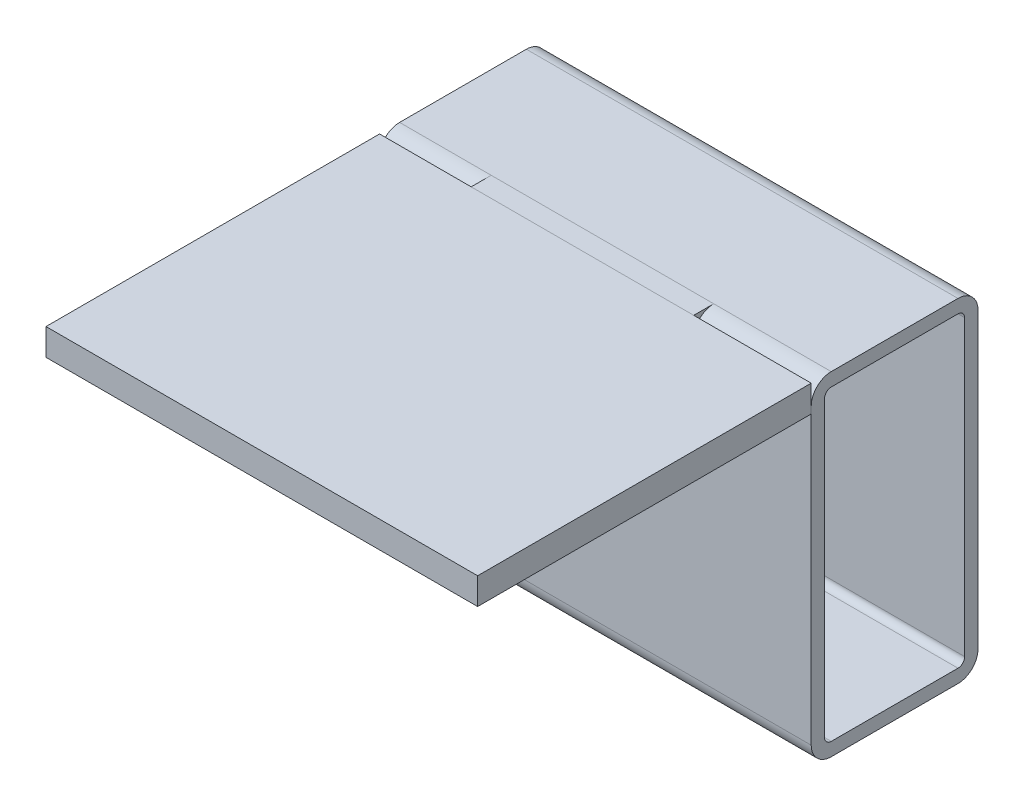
ISO-10303-21;
HEADER;
FILE_DESCRIPTION(('STEP AP214'),'2;1');
FILE_NAME('part.step','',(''),(''),'','','');
FILE_SCHEMA(('AUTOMOTIVE_DESIGN { 1 0 10303 214 1 1 1 1 }'));
ENDSEC;
DATA;
#1=APPLICATION_CONTEXT('core data for automotive mechanical design processes');
#2=APPLICATION_PROTOCOL_DEFINITION('international standard','automotive_design',2000,#1);
#3=PRODUCT_CONTEXT('',#1,'mechanical');
#4=PRODUCT('Part','Part','',(#3));
#5=PRODUCT_RELATED_PRODUCT_CATEGORY('part','',(#4));
#6=PRODUCT_DEFINITION_FORMATION('','',#4);
#7=PRODUCT_DEFINITION_CONTEXT('part definition',#1,'design');
#8=PRODUCT_DEFINITION('design','',#6,#7);
#9=PRODUCT_DEFINITION_SHAPE('','',#8);
#10=(LENGTH_UNIT() NAMED_UNIT(*) SI_UNIT(.MILLI.,.METRE.));
#11=(NAMED_UNIT(*) PLANE_ANGLE_UNIT() SI_UNIT($,.RADIAN.));
#12=(NAMED_UNIT(*) SI_UNIT($,.STERADIAN.) SOLID_ANGLE_UNIT());
#13=UNCERTAINTY_MEASURE_WITH_UNIT(LENGTH_MEASURE(1.E-05),#10,'distance_accuracy_value','');
#14=(GEOMETRIC_REPRESENTATION_CONTEXT(3) GLOBAL_UNCERTAINTY_ASSIGNED_CONTEXT((#13)) GLOBAL_UNIT_ASSIGNED_CONTEXT((#10,
#11,#12)) REPRESENTATION_CONTEXT('',''));
#15=CARTESIAN_POINT('',(0.,0.,0.));
#16=DIRECTION('',(0.,0.,1.));
#17=DIRECTION('',(1.,0.,0.));
#18=AXIS2_PLACEMENT_3D('',#15,#16,#17);
#19=CARTESIAN_POINT('',(-101.938843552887,0.,-5.99999999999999));
#20=DIRECTION('',(0.,-1.,0.));
#21=DIRECTION('',(0.,0.,-1.));
#22=AXIS2_PLACEMENT_3D('',#19,#20,#21);
#23=PLANE('',#22);
#24=DIRECTION('',(0.,0.,1.));
#25=VECTOR('',#24,1.);
#26=CARTESIAN_POINT('',(-101.938843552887,0.,0.));
#27=LINE('',#26,#25);
#28=CARTESIAN_POINT('',(-101.938843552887,0.,-5.99999999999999));
#29=VERTEX_POINT('',#28);
#30=CARTESIAN_POINT('',(-101.938843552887,0.,0.));
#31=VERTEX_POINT('',#30);
#32=EDGE_CURVE('E82',#29,#31,#27,.T.);
#33=ORIENTED_EDGE('',*,*,#32,.T.);
#34=DIRECTION('',(1.,0.,0.));
#35=VECTOR('',#34,1.);
#36=CARTESIAN_POINT('',(-101.938843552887,0.,0.));
#37=LINE('',#36,#35);
#38=CARTESIAN_POINT('',(-35.2215699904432,0.,0.));
#39=VERTEX_POINT('',#38);
#40=EDGE_CURVE('E87',#31,#39,#37,.T.);
#41=ORIENTED_EDGE('',*,*,#40,.T.);
#42=DIRECTION('',(0.,0.,-1.));
#43=VECTOR('',#42,1.);
#44=CARTESIAN_POINT('',(-35.2215699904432,0.,0.));
#45=LINE('',#44,#43);
#46=CARTESIAN_POINT('',(-35.2215699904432,0.,-6.));
#47=VERTEX_POINT('',#46);
#48=EDGE_CURVE('E93',#39,#47,#45,.T.);
#49=ORIENTED_EDGE('',*,*,#48,.T.);
#50=DIRECTION('',(-1.,0.,0.));
#51=VECTOR('',#50,1.);
#52=CARTESIAN_POINT('',(-101.938843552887,0.,-5.99999999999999));
#53=LINE('',#52,#51);
#54=EDGE_CURVE('E62',#47,#29,#53,.T.);
#55=ORIENTED_EDGE('',*,*,#54,.T.);
#56=EDGE_LOOP('',(#33,#41,#49,#55));
#57=FACE_BOUND('',#56,.T.);
#58=ADVANCED_FACE('F46',(#57),#23,.F.);
#59=CARTESIAN_POINT('',(-101.938843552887,-100.001,0.));
#60=DIRECTION('',(0.,0.,1.));
#61=DIRECTION('',(0.,-1.,0.));
#62=AXIS2_PLACEMENT_3D('',#59,#60,#61);
#63=PLANE('',#62);
#64=DIRECTION('',(1.,0.,0.));
#65=VECTOR('',#64,1.);
#66=CARTESIAN_POINT('',(-129.398954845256,-5.99999999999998,0.));
#67=LINE('',#66,#65);
#68=CARTESIAN_POINT('',(-35.2215699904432,-5.99999999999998,0.));
#69=VERTEX_POINT('',#68);
#70=CARTESIAN_POINT('',(-101.938843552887,-5.99999999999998,0.));
#71=VERTEX_POINT('',#70);
#72=EDGE_CURVE('E50',#69,#71,#67,.F.);
#73=ORIENTED_EDGE('',*,*,#72,.F.);
#74=DIRECTION('',(0.,1.,0.));
#75=VECTOR('',#74,1.);
#76=CARTESIAN_POINT('',(-35.2215699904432,-100.001,0.));
#77=LINE('',#76,#75);
#78=EDGE_CURVE('E85',#69,#39,#77,.T.);
#79=ORIENTED_EDGE('',*,*,#78,.T.);
#80=ORIENTED_EDGE('',*,*,#40,.F.);
#81=DIRECTION('',(0.,1.,0.));
#82=VECTOR('',#81,1.);
#83=CARTESIAN_POINT('',(-101.938843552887,-100.001,0.));
#84=LINE('',#83,#82);
#85=EDGE_CURVE('E79',#71,#31,#84,.T.);
#86=ORIENTED_EDGE('',*,*,#85,.F.);
#87=EDGE_LOOP('',(#73,#79,#80,#86));
#88=FACE_BOUND('',#87,.T.);
#89=ADVANCED_FACE('F88',(#88),#63,.T.);
#90=CARTESIAN_POINT('',(-35.2215699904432,-100.001,0.));
#91=DIRECTION('',(1.,0.,0.));
#92=DIRECTION('',(0.,0.,-1.));
#93=AXIS2_PLACEMENT_3D('',#90,#91,#92);
#94=PLANE('',#93);
#95=ORIENTED_EDGE('',*,*,#78,.F.);
#96=CARTESIAN_POINT('',(-35.2215699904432,-5.99999999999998,-6.));
#97=DIRECTION('',(1.,0.,0.));
#98=DIRECTION('',(0.,0.,-1.));
#99=AXIS2_PLACEMENT_3D('',#96,#97,#98);
#100=CIRCLE('',#99,6.00000000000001);
#101=EDGE_CURVE('E12',#69,#47,#100,.F.);
#102=ORIENTED_EDGE('',*,*,#101,.T.);
#103=ORIENTED_EDGE('',*,*,#48,.F.);
#104=EDGE_LOOP('',(#95,#102,#103));
#105=FACE_BOUND('',#104,.T.);
#106=ADVANCED_FACE('F101',(#105),#94,.T.);
#107=CARTESIAN_POINT('',(-101.938843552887,-100.001,0.));
#108=DIRECTION('',(-1.,0.,0.));
#109=DIRECTION('',(0.,0.,1.));
#110=AXIS2_PLACEMENT_3D('',#107,#108,#109);
#111=PLANE('',#110);
#112=ORIENTED_EDGE('',*,*,#32,.F.);
#113=CARTESIAN_POINT('',(-101.938843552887,-5.99999999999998,-6.));
#114=DIRECTION('',(-1.,0.,0.));
#115=DIRECTION('',(0.,0.,1.));
#116=AXIS2_PLACEMENT_3D('',#113,#114,#115);
#117=CIRCLE('',#116,6.00000000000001);
#118=EDGE_CURVE('E83',#29,#71,#117,.F.);
#119=ORIENTED_EDGE('',*,*,#118,.T.);
#120=ORIENTED_EDGE('',*,*,#85,.T.);
#121=EDGE_LOOP('',(#112,#119,#120));
#122=FACE_BOUND('',#121,.T.);
#123=ADVANCED_FACE('F48',(#122),#111,.T.);
#124=CARTESIAN_POINT('',(-129.398954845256,-5.99999999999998,-6.));
#125=DIRECTION('',(1.,0.,0.));
#126=DIRECTION('',(0.,0.,-1.));
#127=AXIS2_PLACEMENT_3D('',#124,#125,#126);
#128=CYLINDRICAL_SURFACE('',#127,6.00000000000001);
#129=ORIENTED_EDGE('',*,*,#54,.F.);
#130=ORIENTED_EDGE('',*,*,#101,.F.);
#131=ORIENTED_EDGE('',*,*,#72,.T.);
#132=ORIENTED_EDGE('',*,*,#118,.F.);
#133=EDGE_LOOP('',(#129,#130,#131,#132));
#134=FACE_BOUND('',#133,.T.);
#135=ADVANCED_FACE('F102',(#134),#128,.F.);
#136=CLOSED_SHELL('',(#58,#89,#106,#123,#135));
#137=MANIFOLD_SOLID_BREP('B2',#136);
#138=CARTESIAN_POINT('',(-129.398954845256,-5.99999999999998,-6.));
#139=DIRECTION('',(1.,0.,0.));
#140=DIRECTION('',(0.,0.,-1.));
#141=AXIS2_PLACEMENT_3D('',#138,#139,#140);
#142=CYLINDRICAL_SURFACE('',#141,2.00000000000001);
#143=CARTESIAN_POINT('',(0.,-5.99999999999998,-6.));
#144=DIRECTION('',(-1.,0.,0.));
#145=DIRECTION('',(0.,0.,-1.));
#146=AXIS2_PLACEMENT_3D('',#143,#144,#145);
#147=CIRCLE('',#146,2.00000000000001);
#148=CARTESIAN_POINT('',(0.,-5.99999999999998,-3.99999999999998));
#149=VERTEX_POINT('',#148);
#150=CARTESIAN_POINT('',(0.,-3.99999999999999,-6.));
#151=VERTEX_POINT('',#150);
#152=EDGE_CURVE('E322',#149,#151,#147,.T.);
#153=ORIENTED_EDGE('',*,*,#152,.F.);
#154=DIRECTION('',(1.,0.,0.));
#155=VECTOR('',#154,1.);
#156=CARTESIAN_POINT('',(-129.398954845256,-5.99999999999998,-3.99999999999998));
#157=LINE('',#156,#155);
#158=CARTESIAN_POINT('',(-129.398954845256,-5.99999999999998,-3.99999999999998));
#159=VERTEX_POINT('',#158);
#160=EDGE_CURVE('E44',#159,#149,#157,.T.);
#161=ORIENTED_EDGE('',*,*,#160,.F.);
#162=CARTESIAN_POINT('',(-129.398954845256,-5.99999999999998,-6.));
#163=DIRECTION('',(-1.,0.,0.));
#164=DIRECTION('',(0.,0.,-1.));
#165=AXIS2_PLACEMENT_3D('',#162,#163,#164);
#166=CIRCLE('',#165,2.00000000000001);
#167=CARTESIAN_POINT('',(-129.398954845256,-3.99999999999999,-6.));
#168=VERTEX_POINT('',#167);
#169=EDGE_CURVE('E407',#159,#168,#166,.T.);
#170=ORIENTED_EDGE('',*,*,#169,.T.);
#171=DIRECTION('',(1.,0.,0.));
#172=VECTOR('',#171,1.);
#173=CARTESIAN_POINT('',(-129.398954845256,-3.99999999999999,-6.));
#174=LINE('',#173,#172);
#175=EDGE_CURVE('E174',#168,#151,#174,.T.);
#176=ORIENTED_EDGE('',*,*,#175,.T.);
#177=EDGE_LOOP('',(#153,#161,#170,#176));
#178=FACE_BOUND('',#177,.T.);
#179=ADVANCED_FACE('F155',(#178),#142,.F.);
#180=CARTESIAN_POINT('',(-129.398954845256,-5.99999999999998,-3.99999999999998));
#181=DIRECTION('',(0.,0.,-1.));
#182=DIRECTION('',(-1.,0.,0.));
#183=AXIS2_PLACEMENT_3D('',#180,#181,#182);
#184=PLANE('',#183);
#185=DIRECTION('',(0.,1.,0.));
#186=VECTOR('',#185,1.);
#187=CARTESIAN_POINT('',(0.,-5.99999999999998,-3.99999999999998));
#188=LINE('',#187,#186);
#189=CARTESIAN_POINT('',(0.,-94.,-3.99999999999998));
#190=VERTEX_POINT('',#189);
#191=EDGE_CURVE('E324',#190,#149,#188,.T.);
#192=ORIENTED_EDGE('',*,*,#191,.F.);
#193=DIRECTION('',(1.,0.,0.));
#194=VECTOR('',#193,1.);
#195=CARTESIAN_POINT('',(-129.398954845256,-94.,-3.99999999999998));
#196=LINE('',#195,#194);
#197=CARTESIAN_POINT('',(-129.398954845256,-94.,-3.99999999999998));
#198=VERTEX_POINT('',#197);
#199=EDGE_CURVE('E165',#198,#190,#196,.T.);
#200=ORIENTED_EDGE('',*,*,#199,.F.);
#201=DIRECTION('',(0.,1.,0.));
#202=VECTOR('',#201,1.);
#203=CARTESIAN_POINT('',(-129.398954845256,-5.99999999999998,-3.99999999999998));
#204=LINE('',#203,#202);
#205=EDGE_CURVE('E409',#198,#159,#204,.T.);
#206=ORIENTED_EDGE('',*,*,#205,.T.);
#207=ORIENTED_EDGE('',*,*,#160,.T.);
#208=EDGE_LOOP('',(#192,#200,#206,#207));
#209=FACE_BOUND('',#208,.T.);
#210=ADVANCED_FACE('F436',(#209),#184,.T.);
#211=CARTESIAN_POINT('',(-129.398954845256,-94.,-5.99999999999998));
#212=DIRECTION('',(1.,0.,0.));
#213=DIRECTION('',(0.,0.,-1.));
#214=AXIS2_PLACEMENT_3D('',#211,#212,#213);
#215=CYLINDRICAL_SURFACE('',#214,2.);
#216=CARTESIAN_POINT('',(0.,-94.,-5.99999999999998));
#217=DIRECTION('',(-1.,0.,0.));
#218=DIRECTION('',(0.,0.,-1.));
#219=AXIS2_PLACEMENT_3D('',#216,#217,#218);
#220=CIRCLE('',#219,2.);
#221=CARTESIAN_POINT('',(0.,-96.,-5.99999999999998));
#222=VERTEX_POINT('',#221);
#223=EDGE_CURVE('E327',#222,#190,#220,.T.);
#224=ORIENTED_EDGE('',*,*,#223,.F.);
#225=DIRECTION('',(1.,0.,0.));
#226=VECTOR('',#225,1.);
#227=CARTESIAN_POINT('',(-129.398954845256,-96.,-5.99999999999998));
#228=LINE('',#227,#226);
#229=CARTESIAN_POINT('',(-129.398954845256,-96.,-5.99999999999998));
#230=VERTEX_POINT('',#229);
#231=EDGE_CURVE('E348',#230,#222,#228,.T.);
#232=ORIENTED_EDGE('',*,*,#231,.F.);
#233=CARTESIAN_POINT('',(-129.398954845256,-94.,-5.99999999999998));
#234=DIRECTION('',(-1.,0.,0.));
#235=DIRECTION('',(0.,0.,-1.));
#236=AXIS2_PLACEMENT_3D('',#233,#234,#235);
#237=CIRCLE('',#236,2.);
#238=EDGE_CURVE('E412',#230,#198,#237,.T.);
#239=ORIENTED_EDGE('',*,*,#238,.T.);
#240=ORIENTED_EDGE('',*,*,#199,.T.);
#241=EDGE_LOOP('',(#224,#232,#239,#240));
#242=FACE_BOUND('',#241,.T.);
#243=ADVANCED_FACE('F441',(#242),#215,.F.);
#244=CARTESIAN_POINT('',(-129.398954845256,-96.,-5.99999999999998));
#245=DIRECTION('',(0.,1.,0.));
#246=DIRECTION('',(0.,0.,1.));
#247=AXIS2_PLACEMENT_3D('',#244,#245,#246);
#248=PLANE('',#247);
#249=DIRECTION('',(0.,0.,1.));
#250=VECTOR('',#249,1.);
#251=CARTESIAN_POINT('',(0.,-96.,-5.99999999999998));
#252=LINE('',#251,#250);
#253=CARTESIAN_POINT('',(0.,-96.,-44.));
#254=VERTEX_POINT('',#253);
#255=EDGE_CURVE('E330',#254,#222,#252,.T.);
#256=ORIENTED_EDGE('',*,*,#255,.F.);
#257=DIRECTION('',(1.,0.,0.));
#258=VECTOR('',#257,1.);
#259=CARTESIAN_POINT('',(-129.398954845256,-96.,-44.));
#260=LINE('',#259,#258);
#261=CARTESIAN_POINT('',(-129.398954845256,-96.,-44.));
#262=VERTEX_POINT('',#261);
#263=EDGE_CURVE('E346',#262,#254,#260,.T.);
#264=ORIENTED_EDGE('',*,*,#263,.F.);
#265=DIRECTION('',(0.,0.,1.));
#266=VECTOR('',#265,1.);
#267=CARTESIAN_POINT('',(-129.398954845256,-96.,-5.99999999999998));
#268=LINE('',#267,#266);
#269=EDGE_CURVE('E415',#262,#230,#268,.T.);
#270=ORIENTED_EDGE('',*,*,#269,.T.);
#271=ORIENTED_EDGE('',*,*,#231,.T.);
#272=EDGE_LOOP('',(#256,#264,#270,#271));
#273=FACE_BOUND('',#272,.T.);
#274=ADVANCED_FACE('F474',(#273),#248,.T.);
#275=CARTESIAN_POINT('',(-129.398954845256,-94.,-44.));
#276=DIRECTION('',(1.,0.,0.));
#277=DIRECTION('',(0.,0.,-1.));
#278=AXIS2_PLACEMENT_3D('',#275,#276,#277);
#279=CYLINDRICAL_SURFACE('',#278,2.00000000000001);
#280=CARTESIAN_POINT('',(0.,-94.,-44.));
#281=DIRECTION('',(-1.,0.,0.));
#282=DIRECTION('',(0.,0.,-1.));
#283=AXIS2_PLACEMENT_3D('',#280,#281,#282);
#284=CIRCLE('',#283,2.00000000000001);
#285=CARTESIAN_POINT('',(0.,-94.,-46.));
#286=VERTEX_POINT('',#285);
#287=EDGE_CURVE('E333',#286,#254,#284,.T.);
#288=ORIENTED_EDGE('',*,*,#287,.F.);
#289=DIRECTION('',(1.,0.,0.));
#290=VECTOR('',#289,1.);
#291=CARTESIAN_POINT('',(-129.398954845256,-94.,-46.));
#292=LINE('',#291,#290);
#293=CARTESIAN_POINT('',(-129.398954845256,-94.,-46.));
#294=VERTEX_POINT('',#293);
#295=EDGE_CURVE('E285',#294,#286,#292,.T.);
#296=ORIENTED_EDGE('',*,*,#295,.F.);
#297=CARTESIAN_POINT('',(-129.398954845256,-94.,-44.));
#298=DIRECTION('',(-1.,0.,0.));
#299=DIRECTION('',(0.,0.,-1.));
#300=AXIS2_PLACEMENT_3D('',#297,#298,#299);
#301=CIRCLE('',#300,2.00000000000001);
#302=EDGE_CURVE('E296',#294,#262,#301,.T.);
#303=ORIENTED_EDGE('',*,*,#302,.T.);
#304=ORIENTED_EDGE('',*,*,#263,.T.);
#305=EDGE_LOOP('',(#288,#296,#303,#304));
#306=FACE_BOUND('',#305,.T.);
#307=ADVANCED_FACE('F419',(#306),#279,.F.);
#308=CARTESIAN_POINT('',(-129.398954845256,-5.99999999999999,-46.));
#309=DIRECTION('',(0.,0.,1.));
#310=DIRECTION('',(1.,0.,0.));
#311=AXIS2_PLACEMENT_3D('',#308,#309,#310);
#312=PLANE('',#311);
#313=DIRECTION('',(0.,-1.,0.));
#314=VECTOR('',#313,1.);
#315=CARTESIAN_POINT('',(0.,-5.99999999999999,-46.));
#316=LINE('',#315,#314);
#317=CARTESIAN_POINT('',(0.,-5.99999999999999,-46.));
#318=VERTEX_POINT('',#317);
#319=EDGE_CURVE('E281',#318,#286,#316,.T.);
#320=ORIENTED_EDGE('',*,*,#319,.F.);
#321=DIRECTION('',(1.,0.,0.));
#322=VECTOR('',#321,1.);
#323=CARTESIAN_POINT('',(-129.398954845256,-5.99999999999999,-46.));
#324=LINE('',#323,#322);
#325=CARTESIAN_POINT('',(-129.398954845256,-5.99999999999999,-46.));
#326=VERTEX_POINT('',#325);
#327=EDGE_CURVE('E276',#326,#318,#324,.T.);
#328=ORIENTED_EDGE('',*,*,#327,.F.);
#329=DIRECTION('',(0.,-1.,0.));
#330=VECTOR('',#329,1.);
#331=CARTESIAN_POINT('',(-129.398954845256,-5.99999999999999,-46.));
#332=LINE('',#331,#330);
#333=EDGE_CURVE('E279',#326,#294,#332,.T.);
#334=ORIENTED_EDGE('',*,*,#333,.T.);
#335=ORIENTED_EDGE('',*,*,#295,.T.);
#336=EDGE_LOOP('',(#320,#328,#334,#335));
#337=FACE_BOUND('',#336,.T.);
#338=ADVANCED_FACE('F278',(#337),#312,.T.);
#339=CARTESIAN_POINT('',(-129.398954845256,-5.99999999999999,-44.));
#340=DIRECTION('',(1.,0.,0.));
#341=DIRECTION('',(0.,0.,-1.));
#342=AXIS2_PLACEMENT_3D('',#339,#340,#341);
#343=CYLINDRICAL_SURFACE('',#342,2.00000000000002);
#344=CARTESIAN_POINT('',(0.,-5.99999999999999,-44.));
#345=DIRECTION('',(-1.,0.,0.));
#346=DIRECTION('',(0.,0.,-1.));
#347=AXIS2_PLACEMENT_3D('',#344,#345,#346);
#348=CIRCLE('',#347,2.00000000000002);
#349=CARTESIAN_POINT('',(0.,-3.99999999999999,-44.));
#350=VERTEX_POINT('',#349);
#351=EDGE_CURVE('E337',#350,#318,#348,.T.);
#352=ORIENTED_EDGE('',*,*,#351,.F.);
#353=DIRECTION('',(1.,0.,0.));
#354=VECTOR('',#353,1.);
#355=CARTESIAN_POINT('',(-129.398954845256,-3.99999999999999,-44.));
#356=LINE('',#355,#354);
#357=CARTESIAN_POINT('',(-129.398954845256,-3.99999999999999,-44.));
#358=VERTEX_POINT('',#357);
#359=EDGE_CURVE('E223',#358,#350,#356,.T.);
#360=ORIENTED_EDGE('',*,*,#359,.F.);
#361=CARTESIAN_POINT('',(-129.398954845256,-5.99999999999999,-44.));
#362=DIRECTION('',(-1.,0.,0.));
#363=DIRECTION('',(0.,0.,-1.));
#364=AXIS2_PLACEMENT_3D('',#361,#362,#363);
#365=CIRCLE('',#364,2.00000000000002);
#366=EDGE_CURVE('E293',#358,#326,#365,.T.);
#367=ORIENTED_EDGE('',*,*,#366,.T.);
#368=ORIENTED_EDGE('',*,*,#327,.T.);
#369=EDGE_LOOP('',(#352,#360,#367,#368));
#370=FACE_BOUND('',#369,.T.);
#371=ADVANCED_FACE('F298',(#370),#343,.F.);
#372=CARTESIAN_POINT('',(-129.398954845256,-94.,-44.));
#373=DIRECTION('',(1.,0.,0.));
#374=DIRECTION('',(0.,0.,-1.));
#375=AXIS2_PLACEMENT_3D('',#372,#373,#374);
#376=CYLINDRICAL_SURFACE('',#375,6.00000000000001);
#377=CARTESIAN_POINT('',(0.,-94.,-44.));
#378=DIRECTION('',(-1.,0.,0.));
#379=DIRECTION('',(0.,0.,-1.));
#380=AXIS2_PLACEMENT_3D('',#377,#378,#379);
#381=CIRCLE('',#380,6.00000000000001);
#382=CARTESIAN_POINT('',(0.,-94.,-50.));
#383=VERTEX_POINT('',#382);
#384=CARTESIAN_POINT('',(0.,-100.,-44.));
#385=VERTEX_POINT('',#384);
#386=EDGE_CURVE('E305',#383,#385,#381,.T.);
#387=ORIENTED_EDGE('',*,*,#386,.T.);
#388=DIRECTION('',(1.,0.,0.));
#389=VECTOR('',#388,1.);
#390=CARTESIAN_POINT('',(-129.398954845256,-100.,-44.));
#391=LINE('',#390,#389);
#392=CARTESIAN_POINT('',(-129.398954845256,-100.,-44.));
#393=VERTEX_POINT('',#392);
#394=EDGE_CURVE('E159',#393,#385,#391,.T.);
#395=ORIENTED_EDGE('',*,*,#394,.F.);
#396=CARTESIAN_POINT('',(-129.398954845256,-94.,-44.));
#397=DIRECTION('',(-1.,0.,0.));
#398=DIRECTION('',(0.,0.,-1.));
#399=AXIS2_PLACEMENT_3D('',#396,#397,#398);
#400=CIRCLE('',#399,6.00000000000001);
#401=CARTESIAN_POINT('',(-129.398954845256,-94.,-50.));
#402=VERTEX_POINT('',#401);
#403=EDGE_CURVE('E342',#402,#393,#400,.T.);
#404=ORIENTED_EDGE('',*,*,#403,.F.);
#405=DIRECTION('',(1.,0.,0.));
#406=VECTOR('',#405,1.);
#407=CARTESIAN_POINT('',(-129.398954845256,-94.,-50.));
#408=LINE('',#407,#406);
#409=EDGE_CURVE('E301',#402,#383,#408,.T.);
#410=ORIENTED_EDGE('',*,*,#409,.T.);
#411=EDGE_LOOP('',(#387,#395,#404,#410));
#412=FACE_BOUND('',#411,.T.);
#413=ADVANCED_FACE('F157',(#412),#376,.T.);
#414=CARTESIAN_POINT('',(-129.398954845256,-100.,-5.99999999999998));
#415=DIRECTION('',(0.,1.,0.));
#416=DIRECTION('',(0.,0.,1.));
#417=AXIS2_PLACEMENT_3D('',#414,#415,#416);
#418=PLANE('',#417);
#419=DIRECTION('',(0.,0.,1.));
#420=VECTOR('',#419,1.);
#421=CARTESIAN_POINT('',(0.,-100.,-5.99999999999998));
#422=LINE('',#421,#420);
#423=CARTESIAN_POINT('',(0.,-100.,-5.99999999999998));
#424=VERTEX_POINT('',#423);
#425=EDGE_CURVE('E308',#385,#424,#422,.T.);
#426=ORIENTED_EDGE('',*,*,#425,.T.);
#427=DIRECTION('',(1.,0.,0.));
#428=VECTOR('',#427,1.);
#429=CARTESIAN_POINT('',(-129.398954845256,-100.,-5.99999999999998));
#430=LINE('',#429,#428);
#431=CARTESIAN_POINT('',(-129.398954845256,-100.,-5.99999999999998));
#432=VERTEX_POINT('',#431);
#433=EDGE_CURVE('E367',#432,#424,#430,.T.);
#434=ORIENTED_EDGE('',*,*,#433,.F.);
#435=DIRECTION('',(0.,0.,1.));
#436=VECTOR('',#435,1.);
#437=CARTESIAN_POINT('',(-129.398954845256,-100.,-5.99999999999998));
#438=LINE('',#437,#436);
#439=EDGE_CURVE('E236',#393,#432,#438,.T.);
#440=ORIENTED_EDGE('',*,*,#439,.F.);
#441=ORIENTED_EDGE('',*,*,#394,.T.);
#442=EDGE_LOOP('',(#426,#434,#440,#441));
#443=FACE_BOUND('',#442,.T.);
#444=ADVANCED_FACE('F373',(#443),#418,.F.);
#445=CARTESIAN_POINT('',(-129.398954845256,-94.,-5.99999999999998));
#446=DIRECTION('',(1.,0.,0.));
#447=DIRECTION('',(0.,0.,-1.));
#448=AXIS2_PLACEMENT_3D('',#445,#446,#447);
#449=CYLINDRICAL_SURFACE('',#448,6.00000000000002);
#450=CARTESIAN_POINT('',(0.,-94.,-5.99999999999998));
#451=DIRECTION('',(-1.,0.,0.));
#452=DIRECTION('',(0.,0.,-1.));
#453=AXIS2_PLACEMENT_3D('',#450,#451,#452);
#454=CIRCLE('',#453,6.00000000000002);
#455=CARTESIAN_POINT('',(0.,-94.,0.));
#456=VERTEX_POINT('',#455);
#457=EDGE_CURVE('E310',#424,#456,#454,.T.);
#458=ORIENTED_EDGE('',*,*,#457,.T.);
#459=DIRECTION('',(1.,0.,0.));
#460=VECTOR('',#459,1.);
#461=CARTESIAN_POINT('',(-129.398954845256,-94.,0.));
#462=LINE('',#461,#460);
#463=CARTESIAN_POINT('',(-129.398954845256,-94.,0.));
#464=VERTEX_POINT('',#463);
#465=EDGE_CURVE('E365',#464,#456,#462,.T.);
#466=ORIENTED_EDGE('',*,*,#465,.F.);
#467=CARTESIAN_POINT('',(-129.398954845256,-94.,-5.99999999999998));
#468=DIRECTION('',(-1.,0.,0.));
#469=DIRECTION('',(0.,0.,-1.));
#470=AXIS2_PLACEMENT_3D('',#467,#468,#469);
#471=CIRCLE('',#470,6.00000000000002);
#472=EDGE_CURVE('E395',#432,#464,#471,.T.);
#473=ORIENTED_EDGE('',*,*,#472,.F.);
#474=ORIENTED_EDGE('',*,*,#433,.T.);
#475=EDGE_LOOP('',(#458,#466,#473,#474));
#476=FACE_BOUND('',#475,.T.);
#477=ADVANCED_FACE('F386',(#476),#449,.T.);
#478=CARTESIAN_POINT('',(-129.398954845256,-5.99999999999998,0.));
#479=DIRECTION('',(0.,0.,-1.));
#480=DIRECTION('',(0.,1.,0.));
#481=AXIS2_PLACEMENT_3D('',#478,#479,#480);
#482=PLANE('',#481);
#483=DIRECTION('',(0.,1.,0.));
#484=VECTOR('',#483,1.);
#485=CARTESIAN_POINT('',(0.,-5.99999999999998,0.));
#486=LINE('',#485,#484);
#487=CARTESIAN_POINT('',(0.,-5.99999999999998,0.));
#488=VERTEX_POINT('',#487);
#489=EDGE_CURVE('E312',#456,#488,#486,.T.);
#490=ORIENTED_EDGE('',*,*,#489,.T.);
#491=DIRECTION('',(1.,0.,0.));
#492=VECTOR('',#491,1.);
#493=CARTESIAN_POINT('',(-129.398954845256,-5.99999999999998,0.));
#494=LINE('',#493,#492);
#495=CARTESIAN_POINT('',(-129.398954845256,-5.99999999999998,0.));
#496=VERTEX_POINT('',#495);
#497=EDGE_CURVE('E362',#496,#488,#494,.T.);
#498=ORIENTED_EDGE('',*,*,#497,.F.);
#499=DIRECTION('',(0.,1.,0.));
#500=VECTOR('',#499,1.);
#501=CARTESIAN_POINT('',(-129.398954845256,-5.99999999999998,0.));
#502=LINE('',#501,#500);
#503=EDGE_CURVE('E391',#464,#496,#502,.T.);
#504=ORIENTED_EDGE('',*,*,#503,.F.);
#505=ORIENTED_EDGE('',*,*,#465,.T.);
#506=EDGE_LOOP('',(#490,#498,#504,#505));
#507=FACE_BOUND('',#506,.T.);
#508=ADVANCED_FACE('F389',(#507),#482,.F.);
#509=CARTESIAN_POINT('',(-129.398954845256,-5.99999999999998,-6.));
#510=DIRECTION('',(1.,0.,0.));
#511=DIRECTION('',(0.,0.,-1.));
#512=AXIS2_PLACEMENT_3D('',#509,#510,#511);
#513=CYLINDRICAL_SURFACE('',#512,6.00000000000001);
#514=CARTESIAN_POINT('',(0.,-5.99999999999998,-6.));
#515=DIRECTION('',(-1.,0.,0.));
#516=DIRECTION('',(0.,0.,-1.));
#517=AXIS2_PLACEMENT_3D('',#514,#515,#516);
#518=CIRCLE('',#517,6.00000000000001);
#519=CARTESIAN_POINT('',(0.,0.,-6.));
#520=VERTEX_POINT('',#519);
#521=EDGE_CURVE('E314',#488,#520,#518,.T.);
#522=ORIENTED_EDGE('',*,*,#521,.T.);
#523=DIRECTION('',(1.,0.,0.));
#524=VECTOR('',#523,1.);
#525=CARTESIAN_POINT('',(-129.398954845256,0.,-6.));
#526=LINE('',#525,#524);
#527=CARTESIAN_POINT('',(-129.398954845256,0.,-6.));
#528=VERTEX_POINT('',#527);
#529=EDGE_CURVE('E359',#528,#520,#526,.T.);
#530=ORIENTED_EDGE('',*,*,#529,.F.);
#531=CARTESIAN_POINT('',(-129.398954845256,-5.99999999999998,-6.));
#532=DIRECTION('',(-1.,0.,0.));
#533=DIRECTION('',(0.,0.,-1.));
#534=AXIS2_PLACEMENT_3D('',#531,#532,#533);
#535=CIRCLE('',#534,6.00000000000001);
#536=EDGE_CURVE('E394',#496,#528,#535,.T.);
#537=ORIENTED_EDGE('',*,*,#536,.F.);
#538=ORIENTED_EDGE('',*,*,#497,.T.);
#539=EDGE_LOOP('',(#522,#530,#537,#538));
#540=FACE_BOUND('',#539,.T.);
#541=ADVANCED_FACE('F452',(#540),#513,.T.);
#542=CARTESIAN_POINT('',(-129.398954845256,0.,-5.99999999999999));
#543=DIRECTION('',(0.,-1.,0.));
#544=DIRECTION('',(0.,0.,-1.));
#545=AXIS2_PLACEMENT_3D('',#542,#543,#544);
#546=PLANE('',#545);
#547=DIRECTION('',(0.,0.,-1.));
#548=VECTOR('',#547,1.);
#549=CARTESIAN_POINT('',(0.,0.,-5.99999999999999));
#550=LINE('',#549,#548);
#551=CARTESIAN_POINT('',(0.,0.,-44.));
#552=VERTEX_POINT('',#551);
#553=EDGE_CURVE('E316',#520,#552,#550,.T.);
#554=ORIENTED_EDGE('',*,*,#553,.T.);
#555=DIRECTION('',(1.,0.,0.));
#556=VECTOR('',#555,1.);
#557=CARTESIAN_POINT('',(-129.398954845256,0.,-44.));
#558=LINE('',#557,#556);
#559=CARTESIAN_POINT('',(-129.398954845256,0.,-44.));
#560=VERTEX_POINT('',#559);
#561=EDGE_CURVE('E356',#560,#552,#558,.T.);
#562=ORIENTED_EDGE('',*,*,#561,.F.);
#563=DIRECTION('',(0.,0.,-1.));
#564=VECTOR('',#563,1.);
#565=CARTESIAN_POINT('',(-129.398954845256,0.,-5.99999999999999));
#566=LINE('',#565,#564);
#567=EDGE_CURVE('E397',#528,#560,#566,.T.);
#568=ORIENTED_EDGE('',*,*,#567,.F.);
#569=ORIENTED_EDGE('',*,*,#529,.T.);
#570=EDGE_LOOP('',(#554,#562,#568,#569));
#571=FACE_BOUND('',#570,.T.);
#572=ADVANCED_FACE('F448',(#571),#546,.F.);
#573=CARTESIAN_POINT('',(-129.398954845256,-5.99999999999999,-44.));
#574=DIRECTION('',(1.,0.,0.));
#575=DIRECTION('',(0.,0.,-1.));
#576=AXIS2_PLACEMENT_3D('',#573,#574,#575);
#577=CYLINDRICAL_SURFACE('',#576,6.00000000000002);
#578=CARTESIAN_POINT('',(0.,-5.99999999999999,-44.));
#579=DIRECTION('',(-1.,0.,0.));
#580=DIRECTION('',(0.,0.,-1.));
#581=AXIS2_PLACEMENT_3D('',#578,#579,#580);
#582=CIRCLE('',#581,6.00000000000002);
#583=CARTESIAN_POINT('',(0.,-5.99999999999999,-50.));
#584=VERTEX_POINT('',#583);
#585=EDGE_CURVE('E318',#552,#584,#582,.T.);
#586=ORIENTED_EDGE('',*,*,#585,.T.);
#587=DIRECTION('',(1.,0.,0.));
#588=VECTOR('',#587,1.);
#589=CARTESIAN_POINT('',(-129.398954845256,-5.99999999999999,-50.));
#590=LINE('',#589,#588);
#591=CARTESIAN_POINT('',(-129.398954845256,-5.99999999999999,-50.));
#592=VERTEX_POINT('',#591);
#593=EDGE_CURVE('E353',#592,#584,#590,.T.);
#594=ORIENTED_EDGE('',*,*,#593,.F.);
#595=CARTESIAN_POINT('',(-129.398954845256,-5.99999999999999,-44.));
#596=DIRECTION('',(-1.,0.,0.));
#597=DIRECTION('',(0.,0.,-1.));
#598=AXIS2_PLACEMENT_3D('',#595,#596,#597);
#599=CIRCLE('',#598,6.00000000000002);
#600=EDGE_CURVE('E403',#560,#592,#599,.T.);
#601=ORIENTED_EDGE('',*,*,#600,.F.);
#602=ORIENTED_EDGE('',*,*,#561,.T.);
#603=EDGE_LOOP('',(#586,#594,#601,#602));
#604=FACE_BOUND('',#603,.T.);
#605=ADVANCED_FACE('F430',(#604),#577,.T.);
#606=CARTESIAN_POINT('',(-129.398954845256,-5.99999999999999,-50.));
#607=DIRECTION('',(0.,0.,1.));
#608=DIRECTION('',(0.,-1.,0.));
#609=AXIS2_PLACEMENT_3D('',#606,#607,#608);
#610=PLANE('',#609);
#611=DIRECTION('',(0.,-1.,0.));
#612=VECTOR('',#611,1.);
#613=CARTESIAN_POINT('',(0.,-5.99999999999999,-50.));
#614=LINE('',#613,#612);
#615=EDGE_CURVE('E320',#584,#383,#614,.T.);
#616=ORIENTED_EDGE('',*,*,#615,.T.);
#617=ORIENTED_EDGE('',*,*,#409,.F.);
#618=DIRECTION('',(0.,-1.,0.));
#619=VECTOR('',#618,1.);
#620=CARTESIAN_POINT('',(-129.398954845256,-5.99999999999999,-50.));
#621=LINE('',#620,#619);
#622=EDGE_CURVE('E405',#592,#402,#621,.T.);
#623=ORIENTED_EDGE('',*,*,#622,.F.);
#624=ORIENTED_EDGE('',*,*,#593,.T.);
#625=EDGE_LOOP('',(#616,#617,#623,#624));
#626=FACE_BOUND('',#625,.T.);
#627=ADVANCED_FACE('F423',(#626),#610,.F.);
#628=CARTESIAN_POINT('',(-129.398954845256,-3.99999999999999,-6.));
#629=DIRECTION('',(0.,-1.,0.));
#630=DIRECTION('',(0.,0.,-1.));
#631=AXIS2_PLACEMENT_3D('',#628,#629,#630);
#632=PLANE('',#631);
#633=DIRECTION('',(0.,0.,-1.));
#634=VECTOR('',#633,1.);
#635=CARTESIAN_POINT('',(0.,-3.99999999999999,-6.));
#636=LINE('',#635,#634);
#637=EDGE_CURVE('E339',#151,#350,#636,.T.);
#638=ORIENTED_EDGE('',*,*,#637,.F.);
#639=ORIENTED_EDGE('',*,*,#175,.F.);
#640=DIRECTION('',(0.,0.,-1.));
#641=VECTOR('',#640,1.);
#642=CARTESIAN_POINT('',(-129.398954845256,-3.99999999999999,-6.));
#643=LINE('',#642,#641);
#644=EDGE_CURVE('E299',#168,#358,#643,.T.);
#645=ORIENTED_EDGE('',*,*,#644,.T.);
#646=ORIENTED_EDGE('',*,*,#359,.T.);
#647=EDGE_LOOP('',(#638,#639,#645,#646));
#648=FACE_BOUND('',#647,.T.);
#649=ADVANCED_FACE('F421',(#648),#632,.T.);
#650=CARTESIAN_POINT('',(-129.398954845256,-94.,-44.));
#651=DIRECTION('',(1.,0.,0.));
#652=DIRECTION('',(0.,0.,-1.));
#653=AXIS2_PLACEMENT_3D('',#650,#651,#652);
#654=PLANE('',#653);
#655=ORIENTED_EDGE('',*,*,#403,.T.);
#656=ORIENTED_EDGE('',*,*,#439,.T.);
#657=ORIENTED_EDGE('',*,*,#472,.T.);
#658=ORIENTED_EDGE('',*,*,#503,.T.);
#659=ORIENTED_EDGE('',*,*,#536,.T.);
#660=ORIENTED_EDGE('',*,*,#567,.T.);
#661=ORIENTED_EDGE('',*,*,#600,.T.);
#662=ORIENTED_EDGE('',*,*,#622,.T.);
#663=EDGE_LOOP('',(#655,#656,#657,#658,#659,#660,#661,#662));
#664=FACE_BOUND('',#663,.T.);
#665=ORIENTED_EDGE('',*,*,#169,.F.);
#666=ORIENTED_EDGE('',*,*,#205,.F.);
#667=ORIENTED_EDGE('',*,*,#238,.F.);
#668=ORIENTED_EDGE('',*,*,#269,.F.);
#669=ORIENTED_EDGE('',*,*,#302,.F.);
#670=ORIENTED_EDGE('',*,*,#333,.F.);
#671=ORIENTED_EDGE('',*,*,#366,.F.);
#672=ORIENTED_EDGE('',*,*,#644,.F.);
#673=EDGE_LOOP('',(#665,#666,#667,#668,#669,#670,#671,#672));
#674=FACE_BOUND('',#673,.T.);
#675=ADVANCED_FACE('F291',(#664,#674),#654,.F.);
#676=CARTESIAN_POINT('',(0.,-94.,-44.));
#677=DIRECTION('',(1.,0.,0.));
#678=DIRECTION('',(0.,0.,-1.));
#679=AXIS2_PLACEMENT_3D('',#676,#677,#678);
#680=PLANE('',#679);
#681=ORIENTED_EDGE('',*,*,#386,.F.);
#682=ORIENTED_EDGE('',*,*,#615,.F.);
#683=ORIENTED_EDGE('',*,*,#585,.F.);
#684=ORIENTED_EDGE('',*,*,#553,.F.);
#685=ORIENTED_EDGE('',*,*,#521,.F.);
#686=ORIENTED_EDGE('',*,*,#489,.F.);
#687=ORIENTED_EDGE('',*,*,#457,.F.);
#688=ORIENTED_EDGE('',*,*,#425,.F.);
#689=EDGE_LOOP('',(#681,#682,#683,#684,#685,#686,#687,#688));
#690=FACE_BOUND('',#689,.T.);
#691=ORIENTED_EDGE('',*,*,#152,.T.);
#692=ORIENTED_EDGE('',*,*,#637,.T.);
#693=ORIENTED_EDGE('',*,*,#351,.T.);
#694=ORIENTED_EDGE('',*,*,#319,.T.);
#695=ORIENTED_EDGE('',*,*,#287,.T.);
#696=ORIENTED_EDGE('',*,*,#255,.T.);
#697=ORIENTED_EDGE('',*,*,#223,.T.);
#698=ORIENTED_EDGE('',*,*,#191,.T.);
#699=EDGE_LOOP('',(#691,#692,#693,#694,#695,#696,#697,#698));
#700=FACE_BOUND('',#699,.T.);
#701=ADVANCED_FACE('F380',(#690,#700),#680,.T.);
#702=CLOSED_SHELL('',(#179,#210,#243,#274,#307,#338,#371,#413,#444,#477,#508,#541,#572,#605,
#627,#649,#675,#701));
#703=MANIFOLD_SOLID_BREP('B6',#702);
#704=CARTESIAN_POINT('',(-129.398954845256,-8.,0.));
#705=DIRECTION('',(0.,0.,1.));
#706=DIRECTION('',(1.,0.,0.));
#707=AXIS2_PLACEMENT_3D('',#704,#705,#706);
#708=PLANE('',#707);
#709=DIRECTION('',(0.,-1.,0.));
#710=VECTOR('',#709,1.);
#711=CARTESIAN_POINT('',(0.,-8.,0.));
#712=LINE('',#711,#710);
#713=CARTESIAN_POINT('',(0.,0.,0.));
#714=VERTEX_POINT('',#713);
#715=CARTESIAN_POINT('',(0.,-8.,0.));
#716=VERTEX_POINT('',#715);
#717=EDGE_CURVE('E692',#714,#716,#712,.T.);
#718=ORIENTED_EDGE('',*,*,#717,.T.);
#719=DIRECTION('',(1.,0.,0.));
#720=VECTOR('',#719,1.);
#721=CARTESIAN_POINT('',(-129.398954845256,-8.,0.));
#722=LINE('',#721,#720);
#723=CARTESIAN_POINT('',(-129.398954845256,-8.,0.));
#724=VERTEX_POINT('',#723);
#725=EDGE_CURVE('E153',#724,#716,#722,.T.);
#726=ORIENTED_EDGE('',*,*,#725,.F.);
#727=DIRECTION('',(0.,-1.,0.));
#728=VECTOR('',#727,1.);
#729=CARTESIAN_POINT('',(-129.398954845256,-8.,0.));
#730=LINE('',#729,#728);
#731=CARTESIAN_POINT('',(-129.398954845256,0.,0.));
#732=VERTEX_POINT('',#731);
#733=EDGE_CURVE('E680',#732,#724,#730,.T.);
#734=ORIENTED_EDGE('',*,*,#733,.F.);
#735=DIRECTION('',(1.,0.,0.));
#736=VECTOR('',#735,1.);
#737=CARTESIAN_POINT('',(-129.398954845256,0.,0.));
#738=LINE('',#737,#736);
#739=EDGE_CURVE('E688',#732,#714,#738,.T.);
#740=ORIENTED_EDGE('',*,*,#739,.T.);
#741=EDGE_LOOP('',(#718,#726,#734,#740));
#742=FACE_BOUND('',#741,.T.);
#743=ADVANCED_FACE('F629',(#742),#708,.F.);
#744=CARTESIAN_POINT('',(-129.398954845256,-8.,0.));
#745=DIRECTION('',(0.,1.,0.));
#746=DIRECTION('',(0.,0.,1.));
#747=AXIS2_PLACEMENT_3D('',#744,#745,#746);
#748=PLANE('',#747);
#749=DIRECTION('',(0.,0.,1.));
#750=VECTOR('',#749,1.);
#751=CARTESIAN_POINT('',(0.,-8.,0.));
#752=LINE('',#751,#750);
#753=CARTESIAN_POINT('',(0.,-8.,100.));
#754=VERTEX_POINT('',#753);
#755=EDGE_CURVE('E684',#716,#754,#752,.T.);
#756=ORIENTED_EDGE('',*,*,#755,.T.);
#757=DIRECTION('',(1.,0.,0.));
#758=VECTOR('',#757,1.);
#759=CARTESIAN_POINT('',(-129.398954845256,-8.,100.));
#760=LINE('',#759,#758);
#761=CARTESIAN_POINT('',(-129.398954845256,-8.,100.));
#762=VERTEX_POINT('',#761);
#763=EDGE_CURVE('E637',#762,#754,#760,.T.);
#764=ORIENTED_EDGE('',*,*,#763,.F.);
#765=DIRECTION('',(0.,0.,1.));
#766=VECTOR('',#765,1.);
#767=CARTESIAN_POINT('',(-129.398954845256,-8.,0.));
#768=LINE('',#767,#766);
#769=EDGE_CURVE('E675',#724,#762,#768,.T.);
#770=ORIENTED_EDGE('',*,*,#769,.F.);
#771=ORIENTED_EDGE('',*,*,#725,.T.);
#772=EDGE_LOOP('',(#756,#764,#770,#771));
#773=FACE_BOUND('',#772,.T.);
#774=ADVANCED_FACE('F683',(#773),#748,.F.);
#775=CARTESIAN_POINT('',(-129.398954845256,-8.,100.));
#776=DIRECTION('',(0.,0.,-1.));
#777=DIRECTION('',(-1.,0.,0.));
#778=AXIS2_PLACEMENT_3D('',#775,#776,#777);
#779=PLANE('',#778);
#780=DIRECTION('',(0.,1.,0.));
#781=VECTOR('',#780,1.);
#782=CARTESIAN_POINT('',(0.,-8.,100.));
#783=LINE('',#782,#781);
#784=CARTESIAN_POINT('',(0.,0.,100.));
#785=VERTEX_POINT('',#784);
#786=EDGE_CURVE('E662',#754,#785,#783,.T.);
#787=ORIENTED_EDGE('',*,*,#786,.T.);
#788=DIRECTION('',(1.,0.,0.));
#789=VECTOR('',#788,1.);
#790=CARTESIAN_POINT('',(-129.398954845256,0.,100.));
#791=LINE('',#790,#789);
#792=CARTESIAN_POINT('',(-129.398954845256,0.,100.));
#793=VERTEX_POINT('',#792);
#794=EDGE_CURVE('E685',#793,#785,#791,.T.);
#795=ORIENTED_EDGE('',*,*,#794,.F.);
#796=DIRECTION('',(0.,1.,0.));
#797=VECTOR('',#796,1.);
#798=CARTESIAN_POINT('',(-129.398954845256,-8.,100.));
#799=LINE('',#798,#797);
#800=EDGE_CURVE('E678',#762,#793,#799,.T.);
#801=ORIENTED_EDGE('',*,*,#800,.F.);
#802=ORIENTED_EDGE('',*,*,#763,.T.);
#803=EDGE_LOOP('',(#787,#795,#801,#802));
#804=FACE_BOUND('',#803,.T.);
#805=ADVANCED_FACE('F686',(#804),#779,.F.);
#806=CARTESIAN_POINT('',(-129.398954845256,0.,0.));
#807=DIRECTION('',(0.,-1.,0.));
#808=DIRECTION('',(0.,0.,-1.));
#809=AXIS2_PLACEMENT_3D('',#806,#807,#808);
#810=PLANE('',#809);
#811=DIRECTION('',(0.,0.,-1.));
#812=VECTOR('',#811,1.);
#813=CARTESIAN_POINT('',(0.,0.,0.));
#814=LINE('',#813,#812);
#815=EDGE_CURVE('E668',#785,#714,#814,.T.);
#816=ORIENTED_EDGE('',*,*,#815,.T.);
#817=ORIENTED_EDGE('',*,*,#739,.F.);
#818=DIRECTION('',(0.,0.,-1.));
#819=VECTOR('',#818,1.);
#820=CARTESIAN_POINT('',(-129.398954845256,0.,0.));
#821=LINE('',#820,#819);
#822=EDGE_CURVE('E645',#793,#732,#821,.T.);
#823=ORIENTED_EDGE('',*,*,#822,.F.);
#824=ORIENTED_EDGE('',*,*,#794,.T.);
#825=EDGE_LOOP('',(#816,#817,#823,#824));
#826=FACE_BOUND('',#825,.T.);
#827=ADVANCED_FACE('F699',(#826),#810,.F.);
#828=CARTESIAN_POINT('',(-129.398954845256,0.,0.));
#829=DIRECTION('',(1.,0.,0.));
#830=DIRECTION('',(0.,0.,-1.));
#831=AXIS2_PLACEMENT_3D('',#828,#829,#830);
#832=PLANE('',#831);
#833=ORIENTED_EDGE('',*,*,#733,.T.);
#834=ORIENTED_EDGE('',*,*,#769,.T.);
#835=ORIENTED_EDGE('',*,*,#800,.T.);
#836=ORIENTED_EDGE('',*,*,#822,.T.);
#837=EDGE_LOOP('',(#833,#834,#835,#836));
#838=FACE_BOUND('',#837,.T.);
#839=ADVANCED_FACE('F676',(#838),#832,.F.);
#840=CARTESIAN_POINT('',(0.,0.,0.));
#841=DIRECTION('',(1.,0.,0.));
#842=DIRECTION('',(0.,0.,-1.));
#843=AXIS2_PLACEMENT_3D('',#840,#841,#842);
#844=PLANE('',#843);
#845=ORIENTED_EDGE('',*,*,#717,.F.);
#846=ORIENTED_EDGE('',*,*,#815,.F.);
#847=ORIENTED_EDGE('',*,*,#786,.F.);
#848=ORIENTED_EDGE('',*,*,#755,.F.);
#849=EDGE_LOOP('',(#845,#846,#847,#848));
#850=FACE_BOUND('',#849,.T.);
#851=ADVANCED_FACE('F702',(#850),#844,.T.);
#852=CLOSED_SHELL('',(#743,#774,#805,#827,#839,#851));
#853=MANIFOLD_SOLID_BREP('B38',#852);
#854=ADVANCED_BREP_SHAPE_REPRESENTATION('',(#18,#137,#703,#853),#14);
#855=SHAPE_DEFINITION_REPRESENTATION(#9,#854);
ENDSEC;
END-ISO-10303-21;
